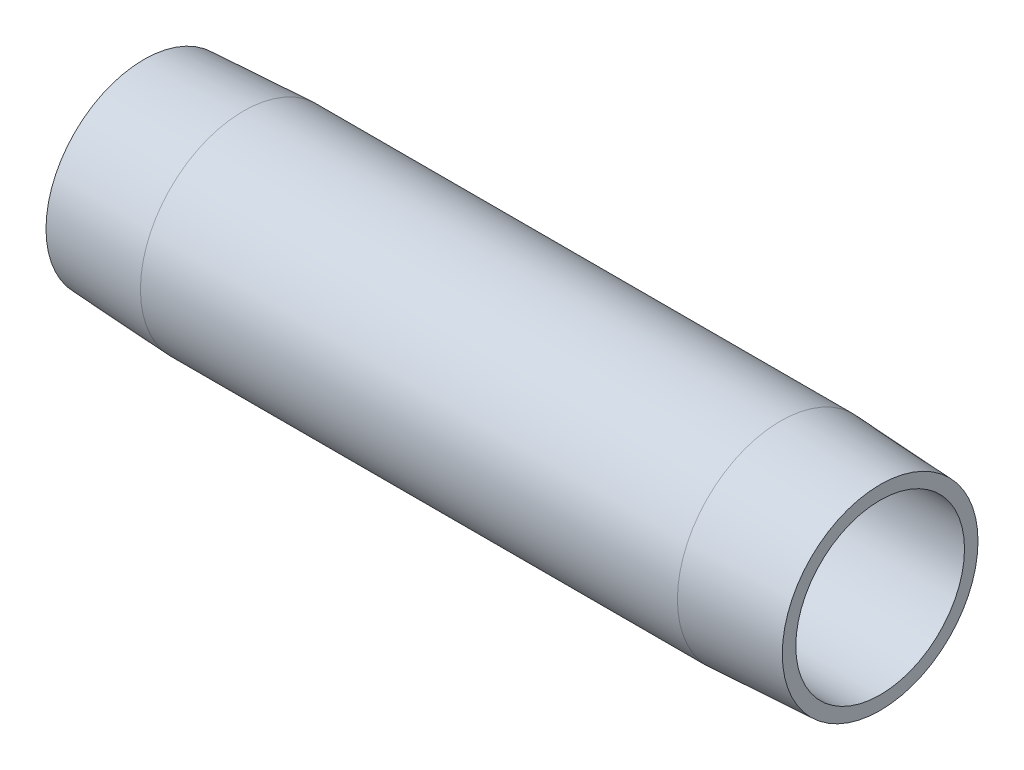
from build123d import *


with BuildPart() as part:
    # Sketch1 → Revolve1 (revolve)
    with BuildSketch(Plane.XY, mode=Mode.PRIVATE) as revolve1_sk:
        Polygon((76.2, 8.73125), (0, 8.73125), (0, 10.127550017), (10.3124, 10.668), (65.8876, 10.668), (76.2, 10.127550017), align=None)
    revolve(revolve1_sk.sketch.rotate(Axis((0, 0, 0), (1, 0, 0)), 90), axis=Axis((0, 0, 0), (1, 0, 0)))


solid = part.part
